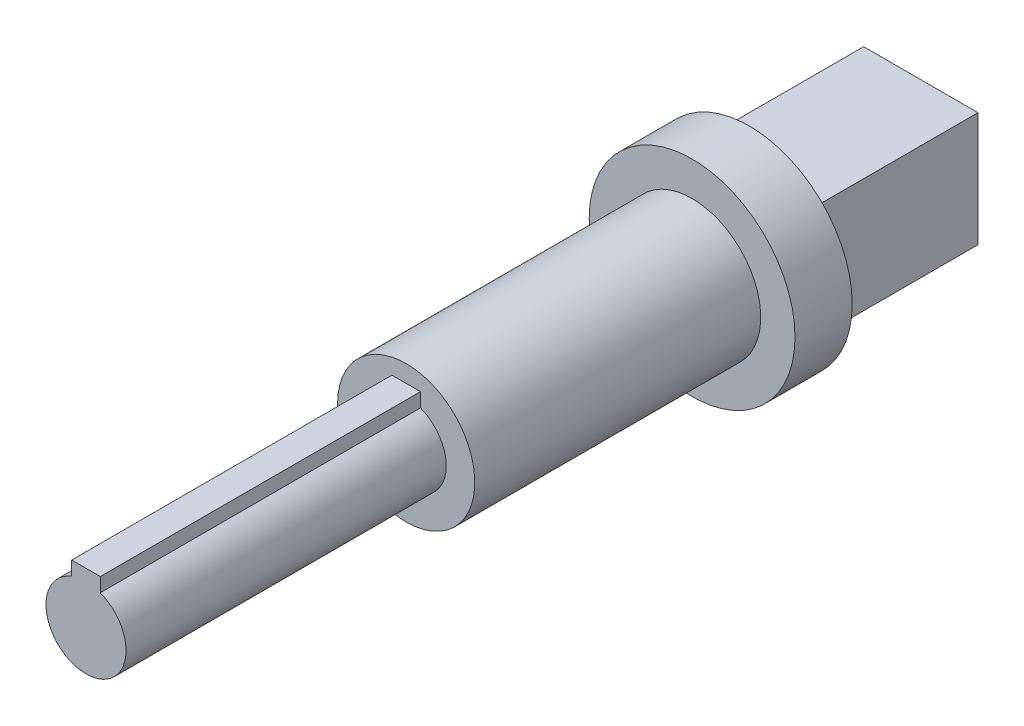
from build123d import *

# Parameters (mm, degrees)
SKETCH1_R           = 152.4
BOSS_EXTRUDE1_DEPTH = 317.5
SKETCH2_R           = 228.6
BOSS_EXTRUDE2_DEPTH = 127
SKETCH3_W           = 254
SKETCH3_H           = 254
BOSS_EXTRUDE3_DEPTH = 381
SKETCH4_R           = 88.9
BOSS_EXTRUDE4_DEPTH = 711.2
BOSS_EXTRUDE5_START = -711.2
BOSS_EXTRUDE5_DEPTH = 711.2


with BuildPart() as part:
    # Sketch1 → Boss-Extrude1 (new, symmetric)
    with BuildSketch(Plane.XY):
        with Locations(Location((0, 0, 0), (0, 0, 180))):
            Circle(SKETCH1_R)
    extrude(amount=BOSS_EXTRUDE1_DEPTH, both=True)

    # Sketch2 → Boss-Extrude2 (add)
    with BuildSketch(Plane.XY.offset(-317.5)):
        Circle(SKETCH2_R)
    extrude(amount=-BOSS_EXTRUDE2_DEPTH)

    # Sketch3 → Boss-Extrude3 (add)
    with BuildSketch(Plane(origin=(0, 0, -444.5), x_dir=(-1, 0, 0), z_dir=(0, 0, -1))):
        Rectangle(SKETCH3_W, SKETCH3_H)
    extrude(amount=BOSS_EXTRUDE3_DEPTH)

    # Sketch4 → Boss-Extrude4 (add)
    with BuildSketch(Plane(origin=(0, 0, 317.5), x_dir=(-1, 0, 0), z_dir=(0, 0, -1))):
        Circle(SKETCH4_R)
    extrude(amount=-BOSS_EXTRUDE4_DEPTH)

    # Sketch5 → Boss-Extrude5 (add)
    with BuildSketch(Plane.XY.offset(1028.7).offset(BOSS_EXTRUDE5_START)):
        with BuildLine():
            Line((-31.75, 114.3), (31.75, 114.3))
            Line((31.75, 114.3), (31.75, 83.037024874))
            ThreePointArc((31.75, 83.037024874), (0, 88.9), (-31.75, 83.037024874))
            Line((-31.75, 83.037024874), (-31.75, 114.3))
        make_face()
    extrude(amount=BOSS_EXTRUDE5_DEPTH)


solid = part.part
